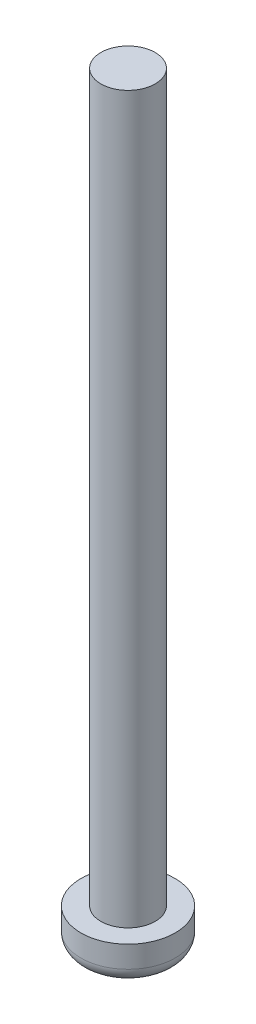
from build123d import *

# Parameters (mm, degrees)
SKETCH1_R      = 4.7625
EXTRUDE1_DEPTH = 127
SKETCH2_R      = 8.255
EXTRUDE2_DEPTH = 6.35
FILLET1_R      = 2.54


with BuildPart() as part:
    # Sketch1 → Extrude1 (new body)
    with BuildSketch(Plane(origin=(0, 0, 0), x_dir=(1, 0, 0), z_dir=(0, 1, 0))):
        with Locations(Location((0, 0, 0), (0, 0, 270))):
            Circle(SKETCH1_R)
    extrude(amount=EXTRUDE1_DEPTH)

    # Sketch2 → Extrude2 (add)
    with BuildSketch(Plane.XZ):
        with Locations(Location((0, 0, 0), (0, 0, 270))):
            Circle(SKETCH2_R)
    extrude(amount=EXTRUDE2_DEPTH)

    # Fillet1
    fillet1_edges = [part.edges().sort_by_distance(p)[0] for p in [
        (0, -6.35, 8.255),
    ]]
    fillet(fillet1_edges, radius=FILLET1_R)


solid = part.part
